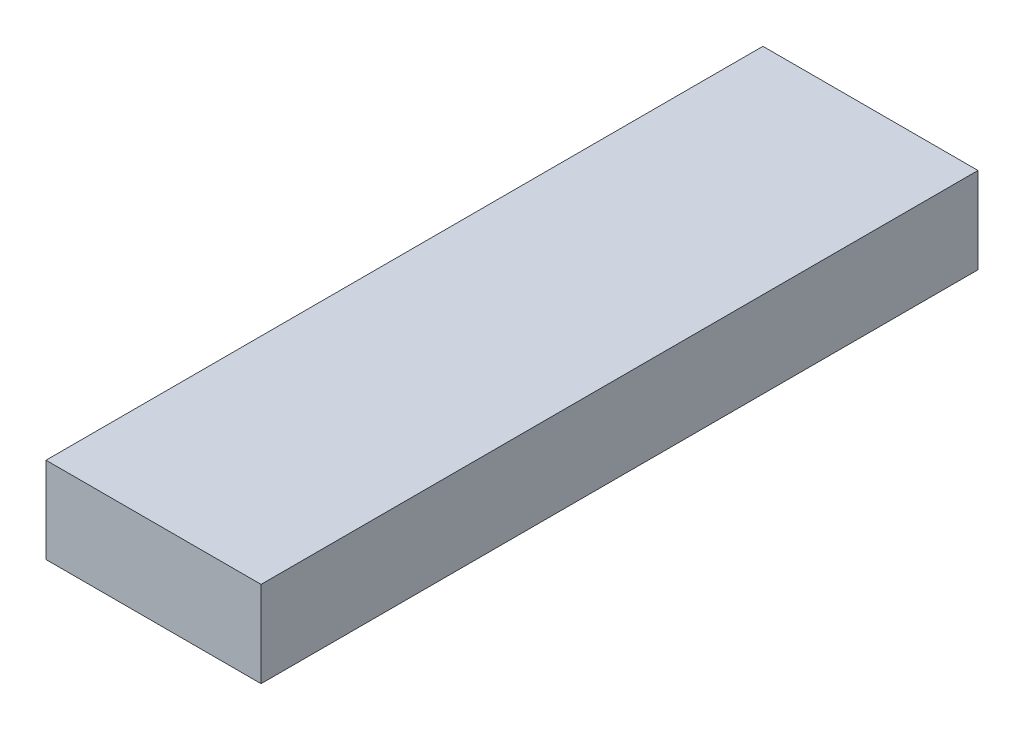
ISO-10303-21;
HEADER;
FILE_DESCRIPTION(('STEP AP214'),'2;1');
FILE_NAME('part.step','',(''),(''),'','','');
FILE_SCHEMA(('AUTOMOTIVE_DESIGN { 1 0 10303 214 1 1 1 1 }'));
ENDSEC;
DATA;
#1=APPLICATION_CONTEXT('core data for automotive mechanical design processes');
#2=APPLICATION_PROTOCOL_DEFINITION('international standard','automotive_design',2000,#1);
#3=PRODUCT_CONTEXT('',#1,'mechanical');
#4=PRODUCT('Part','Part','',(#3));
#5=PRODUCT_RELATED_PRODUCT_CATEGORY('part','',(#4));
#6=PRODUCT_DEFINITION_FORMATION('','',#4);
#7=PRODUCT_DEFINITION_CONTEXT('part definition',#1,'design');
#8=PRODUCT_DEFINITION('design','',#6,#7);
#9=PRODUCT_DEFINITION_SHAPE('','',#8);
#10=(LENGTH_UNIT() NAMED_UNIT(*) SI_UNIT(.MILLI.,.METRE.));
#11=(NAMED_UNIT(*) PLANE_ANGLE_UNIT() SI_UNIT($,.RADIAN.));
#12=(NAMED_UNIT(*) SI_UNIT($,.STERADIAN.) SOLID_ANGLE_UNIT());
#13=UNCERTAINTY_MEASURE_WITH_UNIT(LENGTH_MEASURE(1.E-05),#10,'distance_accuracy_value','');
#14=(GEOMETRIC_REPRESENTATION_CONTEXT(3) GLOBAL_UNCERTAINTY_ASSIGNED_CONTEXT((#13)) GLOBAL_UNIT_ASSIGNED_CONTEXT((#10,
#11,#12)) REPRESENTATION_CONTEXT('',''));
#15=CARTESIAN_POINT('',(0.,0.,0.));
#16=DIRECTION('',(0.,0.,1.));
#17=DIRECTION('',(1.,0.,0.));
#18=AXIS2_PLACEMENT_3D('',#15,#16,#17);
#19=CARTESIAN_POINT('',(0.,0.,150.));
#20=DIRECTION('',(0.,0.,1.));
#21=DIRECTION('',(1.,0.,0.));
#22=AXIS2_PLACEMENT_3D('',#19,#20,#21);
#23=PLANE('',#22);
#24=DIRECTION('',(1.,0.,0.));
#25=VECTOR('',#24,1.);
#26=CARTESIAN_POINT('',(-22.5,-9.,150.));
#27=LINE('',#26,#25);
#28=CARTESIAN_POINT('',(-22.5,-9.,150.));
#29=VERTEX_POINT('',#28);
#30=CARTESIAN_POINT('',(22.5,-9.,150.));
#31=VERTEX_POINT('',#30);
#32=EDGE_CURVE('E81',#29,#31,#27,.T.);
#33=ORIENTED_EDGE('',*,*,#32,.T.);
#34=DIRECTION('',(0.,1.,0.));
#35=VECTOR('',#34,1.);
#36=CARTESIAN_POINT('',(22.5,-9.,150.));
#37=LINE('',#36,#35);
#38=CARTESIAN_POINT('',(22.5,9.,150.));
#39=VERTEX_POINT('',#38);
#40=EDGE_CURVE('E103',#31,#39,#37,.T.);
#41=ORIENTED_EDGE('',*,*,#40,.T.);
#42=DIRECTION('',(-1.,0.,0.));
#43=VECTOR('',#42,1.);
#44=CARTESIAN_POINT('',(22.5,9.,150.));
#45=LINE('',#44,#43);
#46=CARTESIAN_POINT('',(-22.5,9.,150.));
#47=VERTEX_POINT('',#46);
#48=EDGE_CURVE('E74',#39,#47,#45,.T.);
#49=ORIENTED_EDGE('',*,*,#48,.T.);
#50=DIRECTION('',(0.,-1.,0.));
#51=VECTOR('',#50,1.);
#52=CARTESIAN_POINT('',(-22.5,9.,150.));
#53=LINE('',#52,#51);
#54=EDGE_CURVE('E10',#47,#29,#53,.T.);
#55=ORIENTED_EDGE('',*,*,#54,.T.);
#56=EDGE_LOOP('',(#33,#41,#49,#55));
#57=FACE_BOUND('',#56,.T.);
#58=ADVANCED_FACE('F16',(#57),#23,.T.);
#59=CARTESIAN_POINT('',(0.,0.,0.));
#60=DIRECTION('',(0.,0.,1.));
#61=DIRECTION('',(1.,0.,0.));
#62=AXIS2_PLACEMENT_3D('',#59,#60,#61);
#63=PLANE('',#62);
#64=DIRECTION('',(0.,-1.,0.));
#65=VECTOR('',#64,1.);
#66=CARTESIAN_POINT('',(-22.5,9.,0.));
#67=LINE('',#66,#65);
#68=CARTESIAN_POINT('',(-22.5,9.,0.));
#69=VERTEX_POINT('',#68);
#70=CARTESIAN_POINT('',(-22.5,-9.,0.));
#71=VERTEX_POINT('',#70);
#72=EDGE_CURVE('E19',#69,#71,#67,.T.);
#73=ORIENTED_EDGE('',*,*,#72,.F.);
#74=DIRECTION('',(-1.,0.,0.));
#75=VECTOR('',#74,1.);
#76=CARTESIAN_POINT('',(22.5,9.,0.));
#77=LINE('',#76,#75);
#78=CARTESIAN_POINT('',(22.5,9.,0.));
#79=VERTEX_POINT('',#78);
#80=EDGE_CURVE('E107',#79,#69,#77,.T.);
#81=ORIENTED_EDGE('',*,*,#80,.F.);
#82=DIRECTION('',(0.,1.,0.));
#83=VECTOR('',#82,1.);
#84=CARTESIAN_POINT('',(22.5,-9.,0.));
#85=LINE('',#84,#83);
#86=CARTESIAN_POINT('',(22.5,-9.,0.));
#87=VERTEX_POINT('',#86);
#88=EDGE_CURVE('E83',#87,#79,#85,.T.);
#89=ORIENTED_EDGE('',*,*,#88,.F.);
#90=DIRECTION('',(1.,0.,0.));
#91=VECTOR('',#90,1.);
#92=CARTESIAN_POINT('',(-22.5,-9.,0.));
#93=LINE('',#92,#91);
#94=EDGE_CURVE('E79',#71,#87,#93,.T.);
#95=ORIENTED_EDGE('',*,*,#94,.F.);
#96=EDGE_LOOP('',(#73,#81,#89,#95));
#97=FACE_BOUND('',#96,.T.);
#98=ADVANCED_FACE('F85',(#97),#63,.F.);
#99=CARTESIAN_POINT('',(-22.5,9.,0.));
#100=DIRECTION('',(1.,0.,0.));
#101=DIRECTION('',(0.,1.,0.));
#102=AXIS2_PLACEMENT_3D('',#99,#100,#101);
#103=PLANE('',#102);
#104=ORIENTED_EDGE('',*,*,#72,.T.);
#105=DIRECTION('',(0.,0.,1.));
#106=VECTOR('',#105,1.);
#107=CARTESIAN_POINT('',(-22.5,-9.,0.));
#108=LINE('',#107,#106);
#109=EDGE_CURVE('E68',#71,#29,#108,.T.);
#110=ORIENTED_EDGE('',*,*,#109,.T.);
#111=ORIENTED_EDGE('',*,*,#54,.F.);
#112=DIRECTION('',(0.,0.,1.));
#113=VECTOR('',#112,1.);
#114=CARTESIAN_POINT('',(-22.5,9.,0.));
#115=LINE('',#114,#113);
#116=EDGE_CURVE('E71',#69,#47,#115,.T.);
#117=ORIENTED_EDGE('',*,*,#116,.F.);
#118=EDGE_LOOP('',(#104,#110,#111,#117));
#119=FACE_BOUND('',#118,.T.);
#120=ADVANCED_FACE('F67',(#119),#103,.F.);
#121=CARTESIAN_POINT('',(22.5,9.,0.));
#122=DIRECTION('',(0.,-1.,0.));
#123=DIRECTION('',(0.,0.,-1.));
#124=AXIS2_PLACEMENT_3D('',#121,#122,#123);
#125=PLANE('',#124);
#126=ORIENTED_EDGE('',*,*,#80,.T.);
#127=ORIENTED_EDGE('',*,*,#116,.T.);
#128=ORIENTED_EDGE('',*,*,#48,.F.);
#129=DIRECTION('',(0.,0.,1.));
#130=VECTOR('',#129,1.);
#131=CARTESIAN_POINT('',(22.5,9.,0.));
#132=LINE('',#131,#130);
#133=EDGE_CURVE('E99',#79,#39,#132,.T.);
#134=ORIENTED_EDGE('',*,*,#133,.F.);
#135=EDGE_LOOP('',(#126,#127,#128,#134));
#136=FACE_BOUND('',#135,.T.);
#137=ADVANCED_FACE('F116',(#136),#125,.F.);
#138=CARTESIAN_POINT('',(22.5,-9.,0.));
#139=DIRECTION('',(-1.,0.,0.));
#140=DIRECTION('',(0.,0.,1.));
#141=AXIS2_PLACEMENT_3D('',#138,#139,#140);
#142=PLANE('',#141);
#143=ORIENTED_EDGE('',*,*,#88,.T.);
#144=ORIENTED_EDGE('',*,*,#133,.T.);
#145=ORIENTED_EDGE('',*,*,#40,.F.);
#146=DIRECTION('',(0.,0.,1.));
#147=VECTOR('',#146,1.);
#148=CARTESIAN_POINT('',(22.5,-9.,0.));
#149=LINE('',#148,#147);
#150=EDGE_CURVE('E89',#87,#31,#149,.T.);
#151=ORIENTED_EDGE('',*,*,#150,.F.);
#152=EDGE_LOOP('',(#143,#144,#145,#151));
#153=FACE_BOUND('',#152,.T.);
#154=ADVANCED_FACE('F118',(#153),#142,.F.);
#155=CARTESIAN_POINT('',(-22.5,-9.,0.));
#156=DIRECTION('',(0.,1.,0.));
#157=DIRECTION('',(1.,0.,0.));
#158=AXIS2_PLACEMENT_3D('',#155,#156,#157);
#159=PLANE('',#158);
#160=ORIENTED_EDGE('',*,*,#94,.T.);
#161=ORIENTED_EDGE('',*,*,#150,.T.);
#162=ORIENTED_EDGE('',*,*,#32,.F.);
#163=ORIENTED_EDGE('',*,*,#109,.F.);
#164=EDGE_LOOP('',(#160,#161,#162,#163));
#165=FACE_BOUND('',#164,.T.);
#166=ADVANCED_FACE('F77',(#165),#159,.F.);
#167=CLOSED_SHELL('',(#58,#98,#120,#137,#154,#166));
#168=MANIFOLD_SOLID_BREP('B1',#167);
#169=ADVANCED_BREP_SHAPE_REPRESENTATION('',(#18,#168),#14);
#170=SHAPE_DEFINITION_REPRESENTATION(#9,#169);
ENDSEC;
END-ISO-10303-21;
